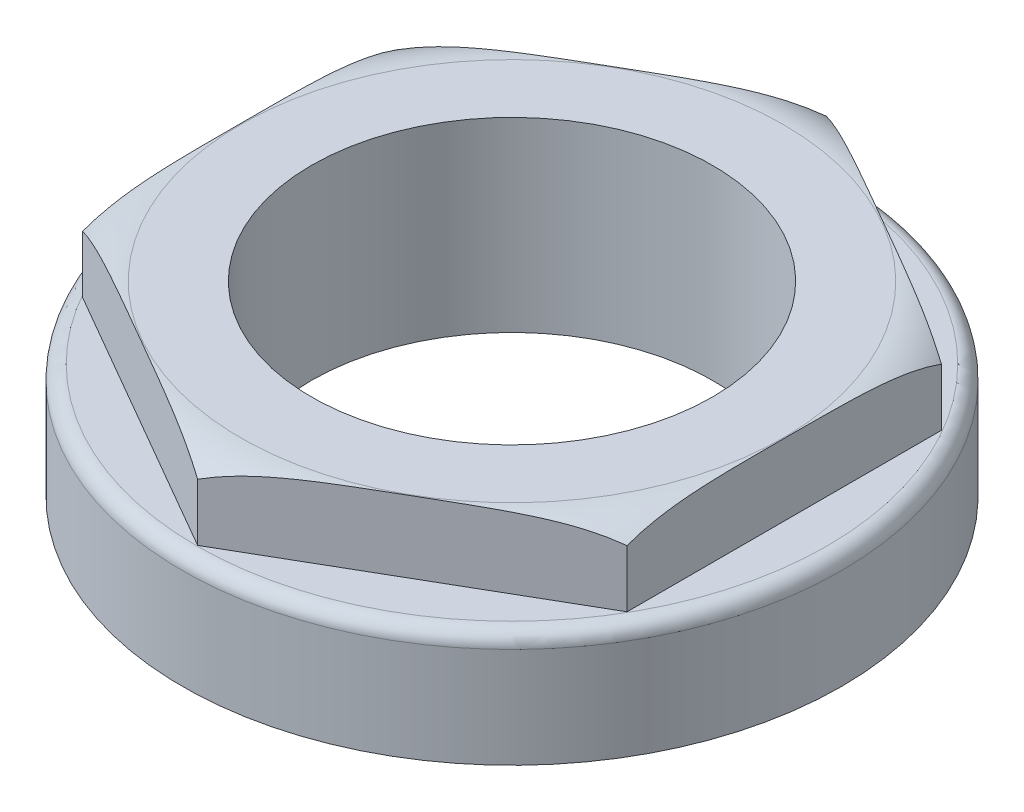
from build123d import *

# Parameters (mm, degrees)
CROQUIS2_R                   = 23
CROQUIS2_R_2                 = 21.5
SALIENTE_EXTRUIR1_DEPTH      = 6
SALIENTE_EXTRUIR2_DEPTH      = 6
SALIENTE_EXTRUIR2_DEPTH_BACK = 7
CROQUIS3_R                   = 17
CROQUIS3_R_2                 = 14
SALIENTE_EXTRUIR3_START      = -2
CROQUIS4_R                   = 14
SALIENTE_EXTRUIR3_DEPTH      = 7
REDONDEO1_R                  = 1


with BuildPart() as part:
    # Croquis1 → Revoluci_n1 (revolve)
    with BuildSketch(Plane.XY):
        Polygon((23, 0), (23, 2), (19, 2), (19, 7), (18, 7), (18, 0), align=None)
    revolve(axis=Axis((0, 0, 0), (0, 1, 0)))

    # Croquis2 → Saliente-Extruir1 (add)
    with BuildSketch(Plane.XZ):
        Circle(CROQUIS2_R)
        Circle(CROQUIS2_R_2, mode=Mode.SUBTRACT)
    extrude(amount=SALIENTE_EXTRUIR1_DEPTH)



with BuildPart() as body_2:
    # Croquis3 → Saliente-Extruir2 (new, two sides: drawn at the far end of the back side and taken through both)
    with BuildSketch(Plane.XZ.offset(-SALIENTE_EXTRUIR2_DEPTH_BACK)):
        Circle(CROQUIS3_R)
        Circle(CROQUIS3_R_2, mode=Mode.SUBTRACT)
    extrude(amount=SALIENTE_EXTRUIR2_DEPTH + SALIENTE_EXTRUIR2_DEPTH_BACK)


with BuildPart() as part_1:
    add(part.part)

    add(body_2.part)  # Saliente-Extruir3 merges body 2
    # Croquis4 → Saliente-Extruir3 (add)
    with BuildSketch(Plane(origin=(0, 2, 0), x_dir=(1, 0, 0), z_dir=(0, 1, 0)).offset(SALIENTE_EXTRUIR3_START)):
        Polygon((0, 21.939310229), (-19, 10.969655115), (-19, -10.969655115), (0, -21.939310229), (19, -10.969655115), (19, 10.969655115), align=None)
        with Locations(Location((0, 0, 0), (0, 0, 180))):
            Circle(CROQUIS4_R, mode=Mode.SUBTRACT)
    extrude(amount=SALIENTE_EXTRUIR3_DEPTH)

    # Croquis5 → Cortar-Revoluci_n1 (revolve, cut)
    with BuildSketch(Plane(origin=(0, 0, 0), x_dir=(0, 0, -1), z_dir=(1, 0, 0)), mode=Mode.PRIVATE) as cortar_revoluci_n1_sk:
        with BuildLine():
            Line((-21.939310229, 7), (-18.939310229, 7))
            ThreePointArc((-18.939310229, 7), (-20.520449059, 6.74341649), (-21.939310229, 6))
            Line((-21.939310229, 6), (-21.939310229, 7))
        make_face()
    revolve(cortar_revoluci_n1_sk.sketch.rotate(Axis((0, 0, 0), (0, 1, 0)), 270), axis=Axis((0, 0, 0), (0, 1, 0)), mode=Mode.SUBTRACT)

    # Redondeo1
    redondeo1_edges = [part_1.edges().sort_by_distance(p)[0] for p in [
        (-23, 2, 0),
    ]]
    fillet(redondeo1_edges, radius=REDONDEO1_R)


solid = part_1.part
